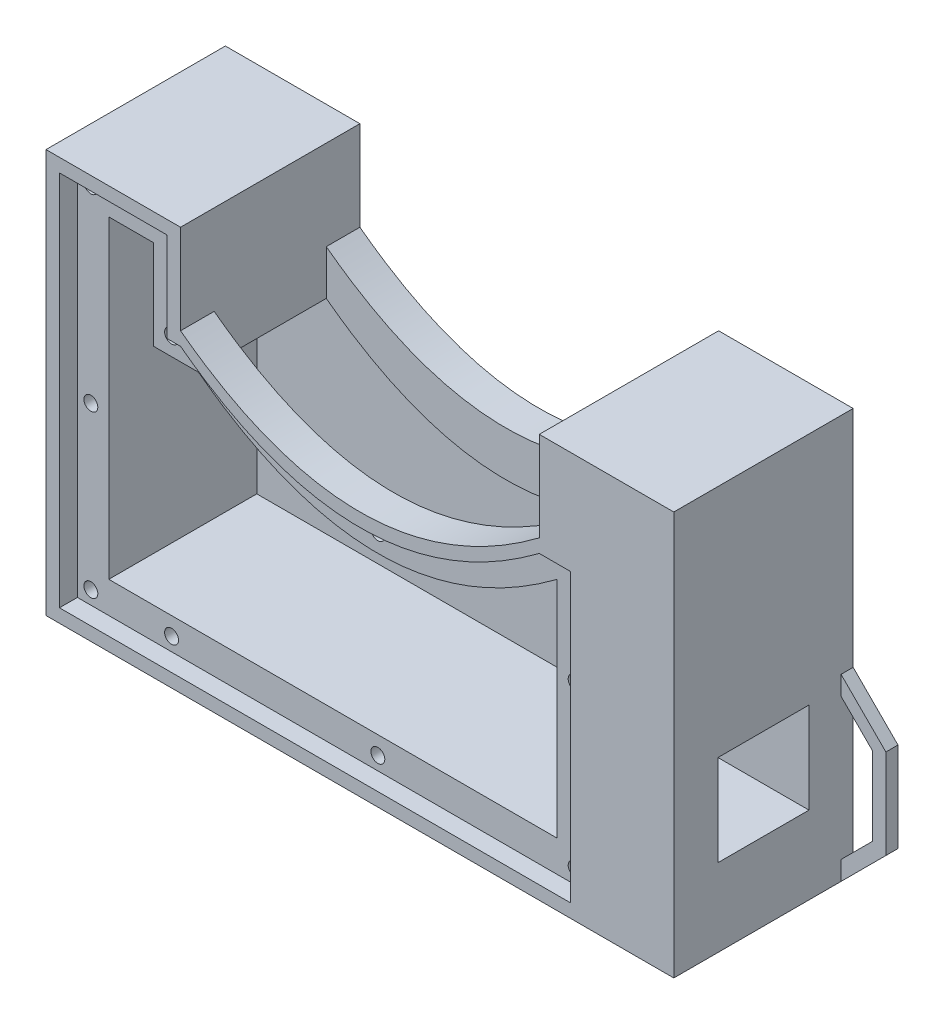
from build123d import *

# Parameters (mm, degrees)
EXTRUDE_1_DEPTH        = 40
CUT_EXTRUDE_2_DEPTH    = 37
SKETCH_4_W             = 20.3
SKETCH_4_H             = 20.3
CUT_EXTRUDE_4_DEPTH    = 24
SKETCH_5_R             = 8.05
CUT_EXTRUDE_5_DEPTH    = 1.7
SKETCH_6_R             = 4
CUT_EXTRUDE_6_DEPTH    = 4.5
CUT_EXTRUDE_7_REACH    = 154.171
SKETCH_7_R             = 1
EXTRUDE_2802_DEPTH     = 2.7
CUT_EXTRUDE_3406_DEPTH = 4
SKETCH_11_R            = 1.55
CUT_EXTRUDE_4207_DEPTH = 4
PROBE_WINDOW_REACH     = 181.444
SKETCH_12_W            = 80
SKETCH_12_H            = 25
CUT_EXTRUDE_4677_REACH = 180.799
SKETCH_13_R            = 2.5
SKETCH_14_R            = 1.55
CUT_EXTRUDE_12_DEPTH   = 3


with BuildPart() as part:
    # Sketch 1 → Extrude 1 (new body)
    with BuildSketch(Plane.XY):
        with BuildLine():
            Line((30, 90), (0, 90))
            Line((0, 90), (0, 0))
            Line((0, 0), (140, 0))
            Line((140, 0), (140, 90))
            Line((140, 90), (110, 90))
            Line((110, 90), (110, 70))
            add(Edge.make_bspline(
                [(30, 70), (70, 40), (110, 70)],
                knots=[0, 0, 0, 1, 1, 1], degree=2))
            Line((30, 70), (30, 90))
        make_face()
    extrude(amount=EXTRUDE_1_DEPTH)

    # Sketch 2 → Cut-Extrude 2 (cut)
    with BuildSketch(Plane.XY.offset(40)):
        with BuildLine():
            Line((10, 80), (10, 10))
            Line((10, 10), (110, 10))
            Line((110, 10), (110, 60))
            add(Edge.make_bspline(
                [(30, 60), (70, 30), (110, 60)],
                knots=[0, 0, 0, 1, 1, 1], degree=2))
            Line((30, 60), (20, 60))
            Line((20, 60), (20, 80))
            Line((20, 80), (10, 80))
        make_face()
    extrude(amount=-CUT_EXTRUDE_2_DEPTH, mode=Mode.SUBTRACT)

    # Sketch 4 → Cut-Extrude 4 (cut)
    with BuildSketch(Plane(origin=(140, 0, 0), x_dir=(0, 0, -1), z_dir=(1, 0, 0))):
        with Locations((-20, 27.5)):
            Rectangle(SKETCH_4_W, SKETCH_4_H)
    extrude(amount=-CUT_EXTRUDE_4_DEPTH, mode=Mode.SUBTRACT)

    # Sketch 5 → Cut-Extrude 5 (cut)
    with BuildSketch(Plane(origin=(116, 0, 0), x_dir=(0, 0, -1), z_dir=(1, 0, 0))):
        with Locations((-20, 27.5)):
            Circle(SKETCH_5_R)
    extrude(amount=-CUT_EXTRUDE_5_DEPTH, mode=Mode.SUBTRACT)

    # Sketch 6 → Cut-Extrude 6 (cut)
    with BuildSketch(Plane(origin=(114.3, 0, 0), x_dir=(0, 0, -1), z_dir=(1, 0, 0))):
        with Locations((-20, 27.5)):
            Circle(SKETCH_6_R)
    extrude(amount=-CUT_EXTRUDE_6_DEPTH, mode=Mode.SUBTRACT)

    # Sketch 7 → Cut-Extrude 7 (cut, up to next)
    with BuildSketch(Plane(origin=(116, 0, 0), x_dir=(0, 0, -1), z_dir=(1, 0, 0)), mode=Mode.PRIVATE) as cut_extrude_7_sk1:
        with Locations((-27.922996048, 35.25)):
            Circle(SKETCH_7_R)
    cut_extrude_7_tool1 = extrude(cut_extrude_7_sk1.sketch, amount=-CUT_EXTRUDE_7_REACH, mode=Mode.PRIVATE) & part.part
    # Sketch 7 → Cut-Extrude 7 (cut, up to next)
    with BuildSketch(Plane(origin=(116, 0, 0), x_dir=(0, 0, -1), z_dir=(1, 0, 0)), mode=Mode.PRIVATE) as cut_extrude_7_sk2:
        with Locations((-12.422996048, 35.25)):
            Circle(SKETCH_7_R)
    cut_extrude_7_tool2 = extrude(cut_extrude_7_sk2.sketch, amount=-CUT_EXTRUDE_7_REACH, mode=Mode.PRIVATE) & part.part
    # Sketch 7 → Cut-Extrude 7 (cut, up to next)
    with BuildSketch(Plane(origin=(116, 0, 0), x_dir=(0, 0, -1), z_dir=(1, 0, 0)), mode=Mode.PRIVATE) as cut_extrude_7_sk3:
        with Locations((-12.422996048, 19.75)):
            Circle(SKETCH_7_R)
    cut_extrude_7_tool3 = extrude(cut_extrude_7_sk3.sketch, amount=-CUT_EXTRUDE_7_REACH, mode=Mode.PRIVATE) & part.part
    # Sketch 7 → Cut-Extrude 7 (cut, up to next)
    with BuildSketch(Plane(origin=(116, 0, 0), x_dir=(0, 0, -1), z_dir=(1, 0, 0)), mode=Mode.PRIVATE) as cut_extrude_7_sk4:
        with Locations((-27.922996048, 19.75)):
            Circle(SKETCH_7_R)
    cut_extrude_7_tool4 = extrude(cut_extrude_7_sk4.sketch, amount=-CUT_EXTRUDE_7_REACH, mode=Mode.PRIVATE) & part.part
    add(cut_extrude_7_tool1.solids().sort_by_distance((116, 35.25, 27.922996))[0], mode=Mode.SUBTRACT)
    add(cut_extrude_7_tool2.solids().sort_by_distance((116, 35.25, 12.422996))[0], mode=Mode.SUBTRACT)
    add(cut_extrude_7_tool3.solids().sort_by_distance((116, 19.75, 12.422996))[0], mode=Mode.SUBTRACT)
    add(cut_extrude_7_tool4.solids().sort_by_distance((116, 19.75, 27.922996))[0], mode=Mode.SUBTRACT)

    # Sketch 8 → Extrude 2802 (add)
    with BuildSketch(Plane(origin=(0, 0, 0), x_dir=(-1, 0, 0), z_dir=(0, 0, -1))):
        Polygon((-140, 35.757359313), (-140, 40), (-150, 30), (-150, 10), (-140, 0), (-140, 4.242640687), (-147, 11.242640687), (-147, 28.757359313), align=None)
        Polygon((10, 30), (0, 40), (0, 35.757359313), (7, 28.757359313), (7, 11.242640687), (0, 4.242640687), (0, 0), (10, 10), align=None)
    extrude(amount=-EXTRUDE_2802_DEPTH)

    # Sketch 9 → Cut-Extrude 3406 (cut)
    with BuildSketch(Plane.XY.offset(40)):
        with BuildLine():
            Line((30, 67), (27, 67))
            Line((27, 67), (27, 87))
            Line((27, 87), (3, 87))
            Line((3, 87), (3, 3))
            Line((3, 3), (117, 3))
            Line((117, 3), (117, 67))
            Line((117, 67), (110, 67))
            add(Edge.make_bspline(
                [(30, 67), (70, 37), (110, 67)],
                knots=[0, 0, 0, 1, 1, 1], degree=2))
        make_face()
    extrude(amount=-CUT_EXTRUDE_3406_DEPTH, mode=Mode.SUBTRACT)

    # Sketch 11 → Cut-Extrude 4207 (cut)
    with BuildSketch(Plane.XY.offset(36)):
        with Locations((6, 84)):
            Circle(SKETCH_11_R)
        with Locations((24, 84)):
            Circle(SKETCH_11_R)
        with Locations((6, 42)):
            Circle(SKETCH_11_R)
        with Locations((6, 6)):
            Circle(SKETCH_11_R)
        with Locations((114, 6)):
            Circle(SKETCH_11_R)
        with Locations((114, 42)):
            Circle(SKETCH_11_R)
        with Locations((24, 64)):
            Circle(SKETCH_11_R)
        with Locations((114, 64)):
            Circle(SKETCH_11_R)
        with Locations((70, 6)):
            Circle(SKETCH_11_R)
        with Locations((24, 6)):
            Circle(SKETCH_11_R)
    extrude(amount=-CUT_EXTRUDE_4207_DEPTH, mode=Mode.SUBTRACT)

    # Sketch 12 → probe window (cut, up to next)
    with BuildSketch(Plane(origin=(0, 90, 0), x_dir=(1, 0, 0), z_dir=(0, 1, 0)), mode=Mode.PRIVATE) as probe_window_sk1:
        with Locations((70, -20)):
            Rectangle(SKETCH_12_W, SKETCH_12_H)
    probe_window_tool1 = extrude(probe_window_sk1.sketch, amount=-PROBE_WINDOW_REACH, mode=Mode.PRIVATE) & part.part
    add(probe_window_tool1.solids().sort_by_distance((70, 90, 20))[0], mode=Mode.SUBTRACT)

    # Sketch 13 → Cut-Extrude 4677 (cut, up to next)
    with BuildSketch(Plane.XY.offset(3), mode=Mode.PRIVATE) as cut_extrude_4677_sk1:
        with Locations((15, 75)):
            Circle(SKETCH_13_R)
    cut_extrude_4677_tool1 = extrude(cut_extrude_4677_sk1.sketch, amount=-CUT_EXTRUDE_4677_REACH, mode=Mode.PRIVATE) & part.part
    add(cut_extrude_4677_tool1.solids().sort_by_distance((15, 75, 3))[0], mode=Mode.SUBTRACT)

    # Sketch 14 → Cut-Extrude 12 (cut)
    with BuildSketch(Plane.XY.offset(36)):
        with Locations((70, 49)):
            Circle(SKETCH_14_R)
    extrude(amount=-CUT_EXTRUDE_12_DEPTH, mode=Mode.SUBTRACT)


solid = part.part
